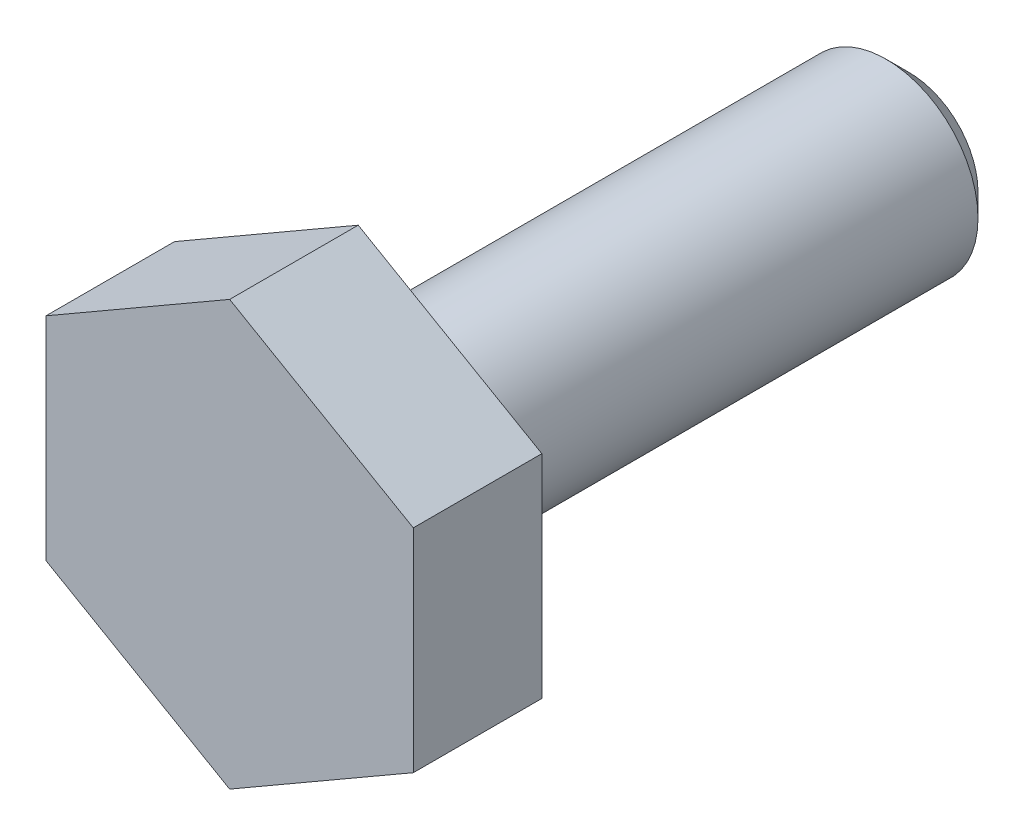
from build123d import *

# Parameters (mm, degrees)
BOSS_EXTRU_1_DEPTH = 1.4
ESQUISSE2_R        = 1
BOSS_EXTRU_2_DEPTH = 6
CHANFREIN1_SIZE    = 0.25


with BuildPart() as part:
    # Esquisse1 → Boss.-Extru.1 (new body)
    with BuildSketch(Plane.XY):
        Polygon((2, -1.154700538), (2, 1.154700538), (0, 2.309401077), (-2, 1.154700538), (-2, -1.154700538), (0, -2.309401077), align=None)
    extrude(amount=BOSS_EXTRU_1_DEPTH)

    # Esquisse2 → Boss.-Extru.2 (add)
    with BuildSketch(Plane.XY):
        Circle(ESQUISSE2_R)
    extrude(amount=-BOSS_EXTRU_2_DEPTH)

    # Chanfrein1
    chanfrein1_edges = [part.edges().sort_by_distance(p)[0] for p in [
        (-1, 0, -6),
    ]]
    chamfer(chanfrein1_edges, length=CHANFREIN1_SIZE)


solid = part.part
